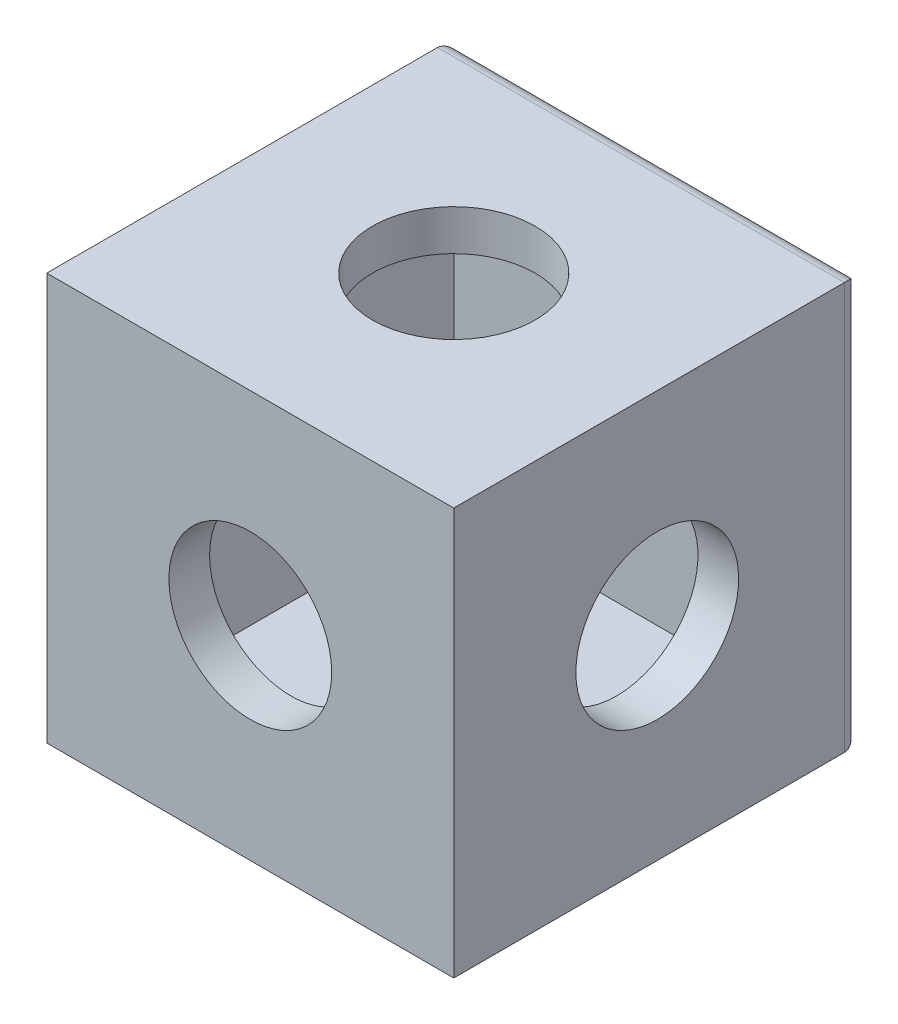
ISO-10303-21;
HEADER;
FILE_DESCRIPTION(('STEP AP214'),'2;1');
FILE_NAME('part.step','',(''),(''),'','','');
FILE_SCHEMA(('AUTOMOTIVE_DESIGN { 1 0 10303 214 1 1 1 1 }'));
ENDSEC;
DATA;
#1=APPLICATION_CONTEXT('core data for automotive mechanical design processes');
#2=APPLICATION_PROTOCOL_DEFINITION('international standard','automotive_design',2000,#1);
#3=PRODUCT_CONTEXT('',#1,'mechanical');
#4=PRODUCT('Part','Part','',(#3));
#5=PRODUCT_RELATED_PRODUCT_CATEGORY('part','',(#4));
#6=PRODUCT_DEFINITION_FORMATION('','',#4);
#7=PRODUCT_DEFINITION_CONTEXT('part definition',#1,'design');
#8=PRODUCT_DEFINITION('design','',#6,#7);
#9=PRODUCT_DEFINITION_SHAPE('','',#8);
#10=(LENGTH_UNIT() NAMED_UNIT(*) SI_UNIT(.MILLI.,.METRE.));
#11=(NAMED_UNIT(*) PLANE_ANGLE_UNIT() SI_UNIT($,.RADIAN.));
#12=(NAMED_UNIT(*) SI_UNIT($,.STERADIAN.) SOLID_ANGLE_UNIT());
#13=UNCERTAINTY_MEASURE_WITH_UNIT(LENGTH_MEASURE(1.E-05),#10,'distance_accuracy_value','');
#14=(GEOMETRIC_REPRESENTATION_CONTEXT(3) GLOBAL_UNCERTAINTY_ASSIGNED_CONTEXT((#13)) GLOBAL_UNIT_ASSIGNED_CONTEXT((#10,
#11,#12)) REPRESENTATION_CONTEXT('',''));
#15=CARTESIAN_POINT('',(0.,0.,0.));
#16=DIRECTION('',(0.,0.,1.));
#17=DIRECTION('',(1.,0.,0.));
#18=AXIS2_PLACEMENT_3D('',#15,#16,#17);
#19=CARTESIAN_POINT('',(50.,50.,125.));
#20=DIRECTION('',(-1.,0.,0.));
#21=DIRECTION('',(0.,-1.,0.));
#22=AXIS2_PLACEMENT_3D('',#19,#20,#21);
#23=PLANE('',#22);
#24=CARTESIAN_POINT('',(50.,0.,62.5));
#25=DIRECTION('',(-1.,0.,0.));
#26=DIRECTION('',(0.,-1.,0.));
#27=AXIS2_PLACEMENT_3D('',#24,#25,#26);
#28=CIRCLE('',#27,25.);
#29=CARTESIAN_POINT('',(50.,-24.9999999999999,62.5));
#30=VERTEX_POINT('',#29);
#31=EDGE_CURVE('E226',#30,#30,#28,.T.);
#32=ORIENTED_EDGE('',*,*,#31,.F.);
#33=EDGE_LOOP('',(#32));
#34=FACE_BOUND('',#33,.T.);
#35=DIRECTION('',(0.,0.,-1.));
#36=VECTOR('',#35,1.);
#37=CARTESIAN_POINT('',(50.,-50.,125.));
#38=LINE('',#37,#36);
#39=CARTESIAN_POINT('',(50.,-50.,112.5));
#40=VERTEX_POINT('',#39);
#41=CARTESIAN_POINT('',(50.,-50.,12.5));
#42=VERTEX_POINT('',#41);
#43=EDGE_CURVE('E135',#40,#42,#38,.T.);
#44=ORIENTED_EDGE('',*,*,#43,.F.);
#45=DIRECTION('',(0.,1.,0.));
#46=VECTOR('',#45,1.);
#47=CARTESIAN_POINT('',(50.,50.,112.5));
#48=LINE('',#47,#46);
#49=CARTESIAN_POINT('',(50.,50.,112.5));
#50=VERTEX_POINT('',#49);
#51=EDGE_CURVE('E122',#40,#50,#48,.T.);
#52=ORIENTED_EDGE('',*,*,#51,.T.);
#53=DIRECTION('',(0.,0.,-1.));
#54=VECTOR('',#53,1.);
#55=CARTESIAN_POINT('',(50.,50.,125.));
#56=LINE('',#55,#54);
#57=CARTESIAN_POINT('',(50.,50.,12.5));
#58=VERTEX_POINT('',#57);
#59=EDGE_CURVE('E133',#50,#58,#56,.T.);
#60=ORIENTED_EDGE('',*,*,#59,.T.);
#61=DIRECTION('',(0.,-1.,0.));
#62=VECTOR('',#61,1.);
#63=CARTESIAN_POINT('',(50.,50.,12.5));
#64=LINE('',#63,#62);
#65=EDGE_CURVE('E233',#58,#42,#64,.T.);
#66=ORIENTED_EDGE('',*,*,#65,.T.);
#67=EDGE_LOOP('',(#44,#52,#60,#66));
#68=FACE_BOUND('',#67,.T.);
#69=ADVANCED_FACE('F40',(#34,#68),#23,.T.);
#70=CARTESIAN_POINT('',(-50.,50.,125.));
#71=DIRECTION('',(0.,-1.,0.));
#72=DIRECTION('',(0.,0.,-1.));
#73=AXIS2_PLACEMENT_3D('',#70,#71,#72);
#74=PLANE('',#73);
#75=CARTESIAN_POINT('',(0.,50.,62.5));
#76=DIRECTION('',(0.,-1.,0.));
#77=DIRECTION('',(0.,0.,-1.));
#78=AXIS2_PLACEMENT_3D('',#75,#76,#77);
#79=CIRCLE('',#78,25.);
#80=CARTESIAN_POINT('',(0.,50.,37.5));
#81=VERTEX_POINT('',#80);
#82=EDGE_CURVE('E214',#81,#81,#79,.T.);
#83=ORIENTED_EDGE('',*,*,#82,.F.);
#84=EDGE_LOOP('',(#83));
#85=FACE_BOUND('',#84,.T.);
#86=ORIENTED_EDGE('',*,*,#59,.F.);
#87=DIRECTION('',(-1.,0.,0.));
#88=VECTOR('',#87,1.);
#89=CARTESIAN_POINT('',(-50.,50.,112.5));
#90=LINE('',#89,#88);
#91=CARTESIAN_POINT('',(-50.,50.,112.5));
#92=VERTEX_POINT('',#91);
#93=EDGE_CURVE('E119',#50,#92,#90,.T.);
#94=ORIENTED_EDGE('',*,*,#93,.T.);
#95=DIRECTION('',(0.,0.,-1.));
#96=VECTOR('',#95,1.);
#97=CARTESIAN_POINT('',(-50.,50.,125.));
#98=LINE('',#97,#96);
#99=CARTESIAN_POINT('',(-50.,50.,12.5));
#100=VERTEX_POINT('',#99);
#101=EDGE_CURVE('E143',#92,#100,#98,.T.);
#102=ORIENTED_EDGE('',*,*,#101,.T.);
#103=DIRECTION('',(1.,0.,0.));
#104=VECTOR('',#103,1.);
#105=CARTESIAN_POINT('',(50.,50.,12.5));
#106=LINE('',#105,#104);
#107=EDGE_CURVE('E141',#100,#58,#106,.T.);
#108=ORIENTED_EDGE('',*,*,#107,.T.);
#109=EDGE_LOOP('',(#86,#94,#102,#108));
#110=FACE_BOUND('',#109,.T.);
#111=ADVANCED_FACE('F139',(#85,#110),#74,.T.);
#112=CARTESIAN_POINT('',(-50.,50.,125.));
#113=DIRECTION('',(1.,0.,0.));
#114=DIRECTION('',(0.,1.,0.));
#115=AXIS2_PLACEMENT_3D('',#112,#113,#114);
#116=PLANE('',#115);
#117=CARTESIAN_POINT('',(-50.,0.,62.5));
#118=DIRECTION('',(1.,0.,0.));
#119=DIRECTION('',(0.,1.,0.));
#120=AXIS2_PLACEMENT_3D('',#117,#118,#119);
#121=CIRCLE('',#120,25.);
#122=CARTESIAN_POINT('',(-50.,25.,62.5));
#123=VERTEX_POINT('',#122);
#124=EDGE_CURVE('E223',#123,#123,#121,.T.);
#125=ORIENTED_EDGE('',*,*,#124,.F.);
#126=EDGE_LOOP('',(#125));
#127=FACE_BOUND('',#126,.T.);
#128=ORIENTED_EDGE('',*,*,#101,.F.);
#129=DIRECTION('',(0.,-1.,0.));
#130=VECTOR('',#129,1.);
#131=CARTESIAN_POINT('',(-50.,50.,112.5));
#132=LINE('',#131,#130);
#133=CARTESIAN_POINT('',(-50.,-50.,112.5));
#134=VERTEX_POINT('',#133);
#135=EDGE_CURVE('E125',#92,#134,#132,.T.);
#136=ORIENTED_EDGE('',*,*,#135,.T.);
#137=DIRECTION('',(0.,0.,-1.));
#138=VECTOR('',#137,1.);
#139=CARTESIAN_POINT('',(-50.,-50.,125.));
#140=LINE('',#139,#138);
#141=CARTESIAN_POINT('',(-50.,-50.,12.5));
#142=VERTEX_POINT('',#141);
#143=EDGE_CURVE('E148',#134,#142,#140,.T.);
#144=ORIENTED_EDGE('',*,*,#143,.T.);
#145=DIRECTION('',(0.,1.,0.));
#146=VECTOR('',#145,1.);
#147=CARTESIAN_POINT('',(-50.,50.,12.5));
#148=LINE('',#147,#146);
#149=EDGE_CURVE('E229',#142,#100,#148,.T.);
#150=ORIENTED_EDGE('',*,*,#149,.T.);
#151=EDGE_LOOP('',(#128,#136,#144,#150));
#152=FACE_BOUND('',#151,.T.);
#153=ADVANCED_FACE('F241',(#127,#152),#116,.T.);
#154=CARTESIAN_POINT('',(-50.,-50.,125.));
#155=DIRECTION('',(0.,1.,0.));
#156=DIRECTION('',(0.,0.,1.));
#157=AXIS2_PLACEMENT_3D('',#154,#155,#156);
#158=PLANE('',#157);
#159=CARTESIAN_POINT('',(0.,-50.,62.5));
#160=DIRECTION('',(0.,1.,0.));
#161=DIRECTION('',(0.,0.,1.));
#162=AXIS2_PLACEMENT_3D('',#159,#160,#161);
#163=CIRCLE('',#162,25.);
#164=CARTESIAN_POINT('',(0.,-50.,87.5));
#165=VERTEX_POINT('',#164);
#166=EDGE_CURVE('E171',#165,#165,#163,.T.);
#167=ORIENTED_EDGE('',*,*,#166,.F.);
#168=EDGE_LOOP('',(#167));
#169=FACE_BOUND('',#168,.T.);
#170=ORIENTED_EDGE('',*,*,#143,.F.);
#171=DIRECTION('',(1.,0.,0.));
#172=VECTOR('',#171,1.);
#173=CARTESIAN_POINT('',(-50.,-50.,112.5));
#174=LINE('',#173,#172);
#175=EDGE_CURVE('E208',#134,#40,#174,.T.);
#176=ORIENTED_EDGE('',*,*,#175,.T.);
#177=ORIENTED_EDGE('',*,*,#43,.T.);
#178=DIRECTION('',(-1.,0.,0.));
#179=VECTOR('',#178,1.);
#180=CARTESIAN_POINT('',(50.,-50.,12.5));
#181=LINE('',#180,#179);
#182=EDGE_CURVE('E235',#42,#142,#181,.T.);
#183=ORIENTED_EDGE('',*,*,#182,.T.);
#184=EDGE_LOOP('',(#170,#176,#177,#183));
#185=FACE_BOUND('',#184,.T.);
#186=ADVANCED_FACE('F246',(#169,#185),#158,.T.);
#187=CARTESIAN_POINT('',(0.,0.,125.));
#188=DIRECTION('',(0.,0.,1.));
#189=DIRECTION('',(1.,0.,0.));
#190=AXIS2_PLACEMENT_3D('',#187,#188,#189);
#191=PLANE('',#190);
#192=CARTESIAN_POINT('',(0.,0.,125.));
#193=DIRECTION('',(0.,0.,1.));
#194=DIRECTION('',(1.,0.,0.));
#195=AXIS2_PLACEMENT_3D('',#192,#193,#194);
#196=CIRCLE('',#195,25.);
#197=CARTESIAN_POINT('',(25.,0.,125.));
#198=VERTEX_POINT('',#197);
#199=EDGE_CURVE('E175',#198,#198,#196,.T.);
#200=ORIENTED_EDGE('',*,*,#199,.F.);
#201=EDGE_LOOP('',(#200));
#202=FACE_BOUND('',#201,.T.);
#203=DIRECTION('',(0.,1.,0.));
#204=VECTOR('',#203,1.);
#205=CARTESIAN_POINT('',(62.5,62.5,125.));
#206=LINE('',#205,#204);
#207=CARTESIAN_POINT('',(62.5,-62.5,125.));
#208=VERTEX_POINT('',#207);
#209=CARTESIAN_POINT('',(62.5,62.5,125.));
#210=VERTEX_POINT('',#209);
#211=EDGE_CURVE('E142',#208,#210,#206,.T.);
#212=ORIENTED_EDGE('',*,*,#211,.T.);
#213=DIRECTION('',(-1.,0.,0.));
#214=VECTOR('',#213,1.);
#215=CARTESIAN_POINT('',(-62.5,62.5,125.));
#216=LINE('',#215,#214);
#217=CARTESIAN_POINT('',(-62.5,62.5,125.));
#218=VERTEX_POINT('',#217);
#219=EDGE_CURVE('E146',#210,#218,#216,.T.);
#220=ORIENTED_EDGE('',*,*,#219,.T.);
#221=DIRECTION('',(0.,-1.,0.));
#222=VECTOR('',#221,1.);
#223=CARTESIAN_POINT('',(-62.5,62.5,125.));
#224=LINE('',#223,#222);
#225=CARTESIAN_POINT('',(-62.5,-62.5,125.));
#226=VERTEX_POINT('',#225);
#227=EDGE_CURVE('E153',#218,#226,#224,.T.);
#228=ORIENTED_EDGE('',*,*,#227,.T.);
#229=DIRECTION('',(1.,0.,0.));
#230=VECTOR('',#229,1.);
#231=CARTESIAN_POINT('',(-62.5,-62.5,125.));
#232=LINE('',#231,#230);
#233=EDGE_CURVE('E155',#226,#208,#232,.T.);
#234=ORIENTED_EDGE('',*,*,#233,.T.);
#235=EDGE_LOOP('',(#212,#220,#228,#234));
#236=FACE_BOUND('',#235,.T.);
#237=ADVANCED_FACE('F248',(#202,#236),#191,.T.);
#238=CARTESIAN_POINT('',(0.,0.,0.));
#239=DIRECTION('',(0.,0.,1.));
#240=DIRECTION('',(1.,0.,0.));
#241=AXIS2_PLACEMENT_3D('',#238,#239,#240);
#242=PLANE('',#241);
#243=DIRECTION('',(1.,0.,0.));
#244=VECTOR('',#243,1.);
#245=CARTESIAN_POINT('',(0.,-57.5,0.));
#246=LINE('',#245,#244);
#247=CARTESIAN_POINT('',(57.5,-57.5,0.));
#248=VERTEX_POINT('',#247);
#249=CARTESIAN_POINT('',(-57.5,-57.5,0.));
#250=VERTEX_POINT('',#249);
#251=EDGE_CURVE('E182',#248,#250,#246,.F.);
#252=ORIENTED_EDGE('',*,*,#251,.T.);
#253=DIRECTION('',(0.,-1.,0.));
#254=VECTOR('',#253,1.);
#255=CARTESIAN_POINT('',(-57.5,0.,0.));
#256=LINE('',#255,#254);
#257=CARTESIAN_POINT('',(-57.5,57.5,0.));
#258=VERTEX_POINT('',#257);
#259=EDGE_CURVE('E184',#250,#258,#256,.F.);
#260=ORIENTED_EDGE('',*,*,#259,.T.);
#261=DIRECTION('',(-1.,0.,0.));
#262=VECTOR('',#261,1.);
#263=CARTESIAN_POINT('',(0.,57.5,0.));
#264=LINE('',#263,#262);
#265=CARTESIAN_POINT('',(57.5,57.5,0.));
#266=VERTEX_POINT('',#265);
#267=EDGE_CURVE('E180',#258,#266,#264,.F.);
#268=ORIENTED_EDGE('',*,*,#267,.T.);
#269=DIRECTION('',(0.,1.,0.));
#270=VECTOR('',#269,1.);
#271=CARTESIAN_POINT('',(57.5,0.,0.));
#272=LINE('',#271,#270);
#273=EDGE_CURVE('E178',#266,#248,#272,.F.);
#274=ORIENTED_EDGE('',*,*,#273,.T.);
#275=EDGE_LOOP('',(#252,#260,#268,#274));
#276=FACE_BOUND('',#275,.T.);
#277=ADVANCED_FACE('F255',(#276),#242,.F.);
#278=CARTESIAN_POINT('',(62.5,62.5,125.));
#279=DIRECTION('',(-1.,0.,0.));
#280=DIRECTION('',(0.,0.,1.));
#281=AXIS2_PLACEMENT_3D('',#278,#279,#280);
#282=PLANE('',#281);
#283=CARTESIAN_POINT('',(62.5,0.,62.5));
#284=DIRECTION('',(-1.,0.,0.));
#285=DIRECTION('',(0.,0.,1.));
#286=AXIS2_PLACEMENT_3D('',#283,#284,#285);
#287=CIRCLE('',#286,25.);
#288=CARTESIAN_POINT('',(62.5,0.,87.5));
#289=VERTEX_POINT('',#288);
#290=EDGE_CURVE('E220',#289,#289,#287,.T.);
#291=ORIENTED_EDGE('',*,*,#290,.T.);
#292=EDGE_LOOP('',(#291));
#293=FACE_BOUND('',#292,.T.);
#294=DIRECTION('',(0.,0.,-1.));
#295=VECTOR('',#294,1.);
#296=CARTESIAN_POINT('',(62.5,-62.5,125.));
#297=LINE('',#296,#295);
#298=CARTESIAN_POINT('',(62.5,-62.5,5.));
#299=VERTEX_POINT('',#298);
#300=EDGE_CURVE('E158',#208,#299,#297,.T.);
#301=ORIENTED_EDGE('',*,*,#300,.T.);
#302=DIRECTION('',(0.,1.,0.));
#303=VECTOR('',#302,1.);
#304=CARTESIAN_POINT('',(62.5,62.5,5.));
#305=LINE('',#304,#303);
#306=CARTESIAN_POINT('',(62.5,62.5,5.));
#307=VERTEX_POINT('',#306);
#308=EDGE_CURVE('E11',#299,#307,#305,.T.);
#309=ORIENTED_EDGE('',*,*,#308,.T.);
#310=DIRECTION('',(0.,0.,-1.));
#311=VECTOR('',#310,1.);
#312=CARTESIAN_POINT('',(62.5,62.5,125.));
#313=LINE('',#312,#311);
#314=EDGE_CURVE('E165',#210,#307,#313,.T.);
#315=ORIENTED_EDGE('',*,*,#314,.F.);
#316=ORIENTED_EDGE('',*,*,#211,.F.);
#317=EDGE_LOOP('',(#301,#309,#315,#316));
#318=FACE_BOUND('',#317,.T.);
#319=ADVANCED_FACE('F274',(#293,#318),#282,.F.);
#320=CARTESIAN_POINT('',(-62.5,62.5,125.));
#321=DIRECTION('',(0.,-1.,0.));
#322=DIRECTION('',(0.,0.,-1.));
#323=AXIS2_PLACEMENT_3D('',#320,#321,#322);
#324=PLANE('',#323);
#325=CARTESIAN_POINT('',(0.,62.5,62.5));
#326=DIRECTION('',(0.,1.,0.));
#327=DIRECTION('',(0.,0.,1.));
#328=AXIS2_PLACEMENT_3D('',#325,#326,#327);
#329=CIRCLE('',#328,25.);
#330=CARTESIAN_POINT('',(0.,62.5,87.5));
#331=VERTEX_POINT('',#330);
#332=EDGE_CURVE('E172',#331,#331,#329,.T.);
#333=ORIENTED_EDGE('',*,*,#332,.F.);
#334=EDGE_LOOP('',(#333));
#335=FACE_BOUND('',#334,.T.);
#336=ORIENTED_EDGE('',*,*,#314,.T.);
#337=DIRECTION('',(-1.,0.,0.));
#338=VECTOR('',#337,1.);
#339=CARTESIAN_POINT('',(-62.5,62.5,5.));
#340=LINE('',#339,#338);
#341=CARTESIAN_POINT('',(-62.5,62.5,5.));
#342=VERTEX_POINT('',#341);
#343=EDGE_CURVE('E49',#307,#342,#340,.T.);
#344=ORIENTED_EDGE('',*,*,#343,.T.);
#345=DIRECTION('',(0.,0.,-1.));
#346=VECTOR('',#345,1.);
#347=CARTESIAN_POINT('',(-62.5,62.5,125.));
#348=LINE('',#347,#346);
#349=EDGE_CURVE('E162',#218,#342,#348,.T.);
#350=ORIENTED_EDGE('',*,*,#349,.F.);
#351=ORIENTED_EDGE('',*,*,#219,.F.);
#352=EDGE_LOOP('',(#336,#344,#350,#351));
#353=FACE_BOUND('',#352,.T.);
#354=ADVANCED_FACE('F283',(#335,#353),#324,.F.);
#355=CARTESIAN_POINT('',(-62.5,62.5,125.));
#356=DIRECTION('',(1.,0.,0.));
#357=DIRECTION('',(0.,1.,0.));
#358=AXIS2_PLACEMENT_3D('',#355,#356,#357);
#359=PLANE('',#358);
#360=CARTESIAN_POINT('',(-62.5,0.,62.5));
#361=DIRECTION('',(-1.,0.,0.));
#362=DIRECTION('',(0.,-1.,0.));
#363=AXIS2_PLACEMENT_3D('',#360,#361,#362);
#364=CIRCLE('',#363,25.);
#365=CARTESIAN_POINT('',(-62.5,-25.,62.5));
#366=VERTEX_POINT('',#365);
#367=EDGE_CURVE('E217',#366,#366,#364,.T.);
#368=ORIENTED_EDGE('',*,*,#367,.F.);
#369=EDGE_LOOP('',(#368));
#370=FACE_BOUND('',#369,.T.);
#371=ORIENTED_EDGE('',*,*,#349,.T.);
#372=DIRECTION('',(0.,-1.,0.));
#373=VECTOR('',#372,1.);
#374=CARTESIAN_POINT('',(-62.5,62.5,5.));
#375=LINE('',#374,#373);
#376=CARTESIAN_POINT('',(-62.5,-62.5,5.));
#377=VERTEX_POINT('',#376);
#378=EDGE_CURVE('E167',#342,#377,#375,.T.);
#379=ORIENTED_EDGE('',*,*,#378,.T.);
#380=DIRECTION('',(0.,0.,-1.));
#381=VECTOR('',#380,1.);
#382=CARTESIAN_POINT('',(-62.5,-62.5,125.));
#383=LINE('',#382,#381);
#384=EDGE_CURVE('E160',#226,#377,#383,.T.);
#385=ORIENTED_EDGE('',*,*,#384,.F.);
#386=ORIENTED_EDGE('',*,*,#227,.F.);
#387=EDGE_LOOP('',(#371,#379,#385,#386));
#388=FACE_BOUND('',#387,.T.);
#389=ADVANCED_FACE('F279',(#370,#388),#359,.F.);
#390=CARTESIAN_POINT('',(-62.5,-62.5,125.));
#391=DIRECTION('',(0.,1.,0.));
#392=DIRECTION('',(0.,0.,1.));
#393=AXIS2_PLACEMENT_3D('',#390,#391,#392);
#394=PLANE('',#393);
#395=CARTESIAN_POINT('',(0.,-62.5,62.5));
#396=DIRECTION('',(0.,1.,0.));
#397=DIRECTION('',(0.,0.,1.));
#398=AXIS2_PLACEMENT_3D('',#395,#396,#397);
#399=CIRCLE('',#398,25.);
#400=CARTESIAN_POINT('',(0.,-62.5,87.5));
#401=VERTEX_POINT('',#400);
#402=EDGE_CURVE('E168',#401,#401,#399,.T.);
#403=ORIENTED_EDGE('',*,*,#402,.T.);
#404=EDGE_LOOP('',(#403));
#405=FACE_BOUND('',#404,.T.);
#406=ORIENTED_EDGE('',*,*,#384,.T.);
#407=DIRECTION('',(1.,0.,0.));
#408=VECTOR('',#407,1.);
#409=CARTESIAN_POINT('',(-62.5,-62.5,5.));
#410=LINE('',#409,#408);
#411=EDGE_CURVE('E63',#377,#299,#410,.T.);
#412=ORIENTED_EDGE('',*,*,#411,.T.);
#413=ORIENTED_EDGE('',*,*,#300,.F.);
#414=ORIENTED_EDGE('',*,*,#233,.F.);
#415=EDGE_LOOP('',(#406,#412,#413,#414));
#416=FACE_BOUND('',#415,.T.);
#417=ADVANCED_FACE('F276',(#405,#416),#394,.F.);
#418=CARTESIAN_POINT('',(0.,0.,12.5));
#419=DIRECTION('',(0.,0.,-1.));
#420=DIRECTION('',(-1.,0.,0.));
#421=AXIS2_PLACEMENT_3D('',#418,#419,#420);
#422=PLANE('',#421);
#423=ORIENTED_EDGE('',*,*,#149,.F.);
#424=ORIENTED_EDGE('',*,*,#182,.F.);
#425=ORIENTED_EDGE('',*,*,#65,.F.);
#426=ORIENTED_EDGE('',*,*,#107,.F.);
#427=EDGE_LOOP('',(#423,#424,#425,#426));
#428=FACE_BOUND('',#427,.T.);
#429=ADVANCED_FACE('F245',(#428),#422,.F.);
#430=CARTESIAN_POINT('',(125.,0.,62.5));
#431=DIRECTION('',(-1.,0.,0.));
#432=DIRECTION('',(0.,-1.,0.));
#433=AXIS2_PLACEMENT_3D('',#430,#431,#432);
#434=CYLINDRICAL_SURFACE('',#433,25.);
#435=ORIENTED_EDGE('',*,*,#124,.T.);
#436=EDGE_LOOP('',(#435));
#437=FACE_BOUND('',#436,.T.);
#438=ORIENTED_EDGE('',*,*,#367,.T.);
#439=EDGE_LOOP('',(#438));
#440=FACE_BOUND('',#439,.T.);
#441=ADVANCED_FACE('F335',(#437,#440),#434,.F.);
#442=ORIENTED_EDGE('',*,*,#31,.T.);
#443=EDGE_LOOP('',(#442));
#444=FACE_BOUND('',#443,.T.);
#445=ORIENTED_EDGE('',*,*,#290,.F.);
#446=EDGE_LOOP('',(#445));
#447=FACE_BOUND('',#446,.T.);
#448=ADVANCED_FACE('F333',(#444,#447),#434,.F.);
#449=CARTESIAN_POINT('',(0.,-125.,62.5));
#450=DIRECTION('',(0.,1.,0.));
#451=DIRECTION('',(0.,0.,1.));
#452=AXIS2_PLACEMENT_3D('',#449,#450,#451);
#453=CYLINDRICAL_SURFACE('',#452,25.);
#454=ORIENTED_EDGE('',*,*,#166,.T.);
#455=EDGE_LOOP('',(#454));
#456=FACE_BOUND('',#455,.T.);
#457=ORIENTED_EDGE('',*,*,#402,.F.);
#458=EDGE_LOOP('',(#457));
#459=FACE_BOUND('',#458,.T.);
#460=ADVANCED_FACE('F331',(#456,#459),#453,.F.);
#461=ORIENTED_EDGE('',*,*,#82,.T.);
#462=EDGE_LOOP('',(#461));
#463=FACE_BOUND('',#462,.T.);
#464=ORIENTED_EDGE('',*,*,#332,.T.);
#465=EDGE_LOOP('',(#464));
#466=FACE_BOUND('',#465,.T.);
#467=ADVANCED_FACE('F324',(#463,#466),#453,.F.);
#468=CARTESIAN_POINT('',(0.,0.,112.5));
#469=DIRECTION('',(0.,0.,1.));
#470=DIRECTION('',(1.,0.,0.));
#471=AXIS2_PLACEMENT_3D('',#468,#469,#470);
#472=PLANE('',#471);
#473=CARTESIAN_POINT('',(0.,0.,112.5));
#474=DIRECTION('',(0.,0.,1.));
#475=DIRECTION('',(1.,0.,0.));
#476=AXIS2_PLACEMENT_3D('',#473,#474,#475);
#477=CIRCLE('',#476,25.);
#478=CARTESIAN_POINT('',(25.,0.,112.5));
#479=VERTEX_POINT('',#478);
#480=EDGE_CURVE('E136',#479,#479,#477,.T.);
#481=ORIENTED_EDGE('',*,*,#480,.T.);
#482=EDGE_LOOP('',(#481));
#483=FACE_BOUND('',#482,.T.);
#484=ORIENTED_EDGE('',*,*,#51,.F.);
#485=ORIENTED_EDGE('',*,*,#175,.F.);
#486=ORIENTED_EDGE('',*,*,#135,.F.);
#487=ORIENTED_EDGE('',*,*,#93,.F.);
#488=EDGE_LOOP('',(#484,#485,#486,#487));
#489=FACE_BOUND('',#488,.T.);
#490=ADVANCED_FACE('F121',(#483,#489),#472,.F.);
#491=CARTESIAN_POINT('',(0.,0.,85.5));
#492=DIRECTION('',(0.,0.,1.));
#493=DIRECTION('',(1.,0.,0.));
#494=AXIS2_PLACEMENT_3D('',#491,#492,#493);
#495=CYLINDRICAL_SURFACE('',#494,25.);
#496=ORIENTED_EDGE('',*,*,#199,.T.);
#497=EDGE_LOOP('',(#496));
#498=FACE_BOUND('',#497,.T.);
#499=ORIENTED_EDGE('',*,*,#480,.F.);
#500=EDGE_LOOP('',(#499));
#501=FACE_BOUND('',#500,.T.);
#502=ADVANCED_FACE('F302',(#498,#501),#495,.F.);
#503=CARTESIAN_POINT('',(57.5,62.5,5.));
#504=DIRECTION('',(0.,1.,0.));
#505=DIRECTION('',(0.,0.,1.));
#506=AXIS2_PLACEMENT_3D('',#503,#504,#505);
#507=CYLINDRICAL_SURFACE('',#506,5.);
#508=CARTESIAN_POINT('',(57.5,-57.5,5.));
#509=DIRECTION('',(0.707106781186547,0.707106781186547,0.));
#510=DIRECTION('',(-0.707106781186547,0.707106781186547,0.));
#511=AXIS2_PLACEMENT_3D('',#508,#509,#510);
#512=ELLIPSE('',#511,7.07106781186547,5.);
#513=EDGE_CURVE('E192',#248,#299,#512,.F.);
#514=ORIENTED_EDGE('',*,*,#513,.F.);
#515=ORIENTED_EDGE('',*,*,#273,.F.);
#516=CARTESIAN_POINT('',(57.5,57.5,5.));
#517=DIRECTION('',(-0.707106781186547,0.707106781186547,0.));
#518=DIRECTION('',(0.707106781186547,0.707106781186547,0.));
#519=AXIS2_PLACEMENT_3D('',#516,#517,#518);
#520=ELLIPSE('',#519,7.07106781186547,5.);
#521=EDGE_CURVE('E44',#307,#266,#520,.T.);
#522=ORIENTED_EDGE('',*,*,#521,.F.);
#523=ORIENTED_EDGE('',*,*,#308,.F.);
#524=EDGE_LOOP('',(#514,#515,#522,#523));
#525=FACE_BOUND('',#524,.T.);
#526=ADVANCED_FACE('F42',(#525),#507,.T.);
#527=CARTESIAN_POINT('',(-62.5,57.5,5.));
#528=DIRECTION('',(-1.,0.,0.));
#529=DIRECTION('',(0.,0.,1.));
#530=AXIS2_PLACEMENT_3D('',#527,#528,#529);
#531=CYLINDRICAL_SURFACE('',#530,5.);
#532=ORIENTED_EDGE('',*,*,#521,.T.);
#533=ORIENTED_EDGE('',*,*,#267,.F.);
#534=CARTESIAN_POINT('',(-57.5,57.5,5.));
#535=DIRECTION('',(-0.707106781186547,-0.707106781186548,0.));
#536=DIRECTION('',(-0.707106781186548,0.707106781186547,0.));
#537=AXIS2_PLACEMENT_3D('',#534,#535,#536);
#538=ELLIPSE('',#537,7.07106781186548,5.);
#539=EDGE_CURVE('E191',#342,#258,#538,.T.);
#540=ORIENTED_EDGE('',*,*,#539,.F.);
#541=ORIENTED_EDGE('',*,*,#343,.F.);
#542=EDGE_LOOP('',(#532,#533,#540,#541));
#543=FACE_BOUND('',#542,.T.);
#544=ADVANCED_FACE('F297',(#543),#531,.T.);
#545=CARTESIAN_POINT('',(-62.5,-57.5,5.));
#546=DIRECTION('',(1.,0.,0.));
#547=DIRECTION('',(0.,0.,-1.));
#548=AXIS2_PLACEMENT_3D('',#545,#546,#547);
#549=CYLINDRICAL_SURFACE('',#548,5.);
#550=ORIENTED_EDGE('',*,*,#513,.T.);
#551=ORIENTED_EDGE('',*,*,#411,.F.);
#552=CARTESIAN_POINT('',(-57.5,-57.5,5.));
#553=DIRECTION('',(0.707106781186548,-0.707106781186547,0.));
#554=DIRECTION('',(0.707106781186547,0.707106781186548,0.));
#555=AXIS2_PLACEMENT_3D('',#552,#553,#554);
#556=ELLIPSE('',#555,7.07106781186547,5.);
#557=EDGE_CURVE('E189',#250,#377,#556,.F.);
#558=ORIENTED_EDGE('',*,*,#557,.F.);
#559=ORIENTED_EDGE('',*,*,#251,.F.);
#560=EDGE_LOOP('',(#550,#551,#558,#559));
#561=FACE_BOUND('',#560,.T.);
#562=ADVANCED_FACE('F294',(#561),#549,.T.);
#563=CARTESIAN_POINT('',(-57.5,62.5,5.));
#564=DIRECTION('',(0.,-1.,0.));
#565=DIRECTION('',(1.,0.,0.));
#566=AXIS2_PLACEMENT_3D('',#563,#564,#565);
#567=CYLINDRICAL_SURFACE('',#566,5.);
#568=ORIENTED_EDGE('',*,*,#539,.T.);
#569=ORIENTED_EDGE('',*,*,#259,.F.);
#570=ORIENTED_EDGE('',*,*,#557,.T.);
#571=ORIENTED_EDGE('',*,*,#378,.F.);
#572=EDGE_LOOP('',(#568,#569,#570,#571));
#573=FACE_BOUND('',#572,.T.);
#574=ADVANCED_FACE('F291',(#573),#567,.T.);
#575=CLOSED_SHELL('',(#69,#111,#153,#186,#237,#277,#319,#354,#389,#417,#429,#441,#448,#460,#467,
#490,#502,#526,#544,#562,#574));
#576=MANIFOLD_SOLID_BREP('B2',#575);
#577=ADVANCED_BREP_SHAPE_REPRESENTATION('',(#18,#576),#14);
#578=SHAPE_DEFINITION_REPRESENTATION(#9,#577);
ENDSEC;
END-ISO-10303-21;
